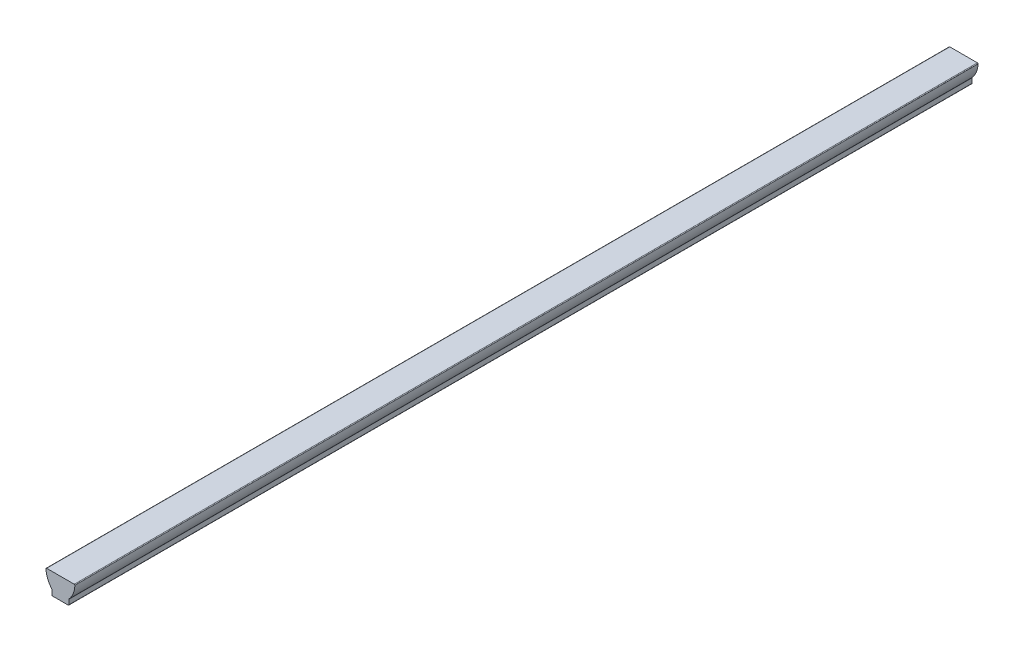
ISO-10303-21;
HEADER;
FILE_DESCRIPTION(('STEP AP214'),'2;1');
FILE_NAME('part.step','',(''),(''),'','','');
FILE_SCHEMA(('AUTOMOTIVE_DESIGN { 1 0 10303 214 1 1 1 1 }'));
ENDSEC;
DATA;
#1=APPLICATION_CONTEXT('core data for automotive mechanical design processes');
#2=APPLICATION_PROTOCOL_DEFINITION('international standard','automotive_design',2000,#1);
#3=PRODUCT_CONTEXT('',#1,'mechanical');
#4=PRODUCT('Part','Part','',(#3));
#5=PRODUCT_RELATED_PRODUCT_CATEGORY('part','',(#4));
#6=PRODUCT_DEFINITION_FORMATION('','',#4);
#7=PRODUCT_DEFINITION_CONTEXT('part definition',#1,'design');
#8=PRODUCT_DEFINITION('design','',#6,#7);
#9=PRODUCT_DEFINITION_SHAPE('','',#8);
#10=(LENGTH_UNIT() NAMED_UNIT(*) SI_UNIT(.MILLI.,.METRE.));
#11=(NAMED_UNIT(*) PLANE_ANGLE_UNIT() SI_UNIT($,.RADIAN.));
#12=(NAMED_UNIT(*) SI_UNIT($,.STERADIAN.) SOLID_ANGLE_UNIT());
#13=UNCERTAINTY_MEASURE_WITH_UNIT(LENGTH_MEASURE(1.E-05),#10,'distance_accuracy_value','');
#14=(GEOMETRIC_REPRESENTATION_CONTEXT(3) GLOBAL_UNCERTAINTY_ASSIGNED_CONTEXT((#13)) GLOBAL_UNIT_ASSIGNED_CONTEXT((#10,
#11,#12)) REPRESENTATION_CONTEXT('',''));
#15=CARTESIAN_POINT('',(0.,0.,0.));
#16=DIRECTION('',(0.,0.,1.));
#17=DIRECTION('',(1.,0.,0.));
#18=AXIS2_PLACEMENT_3D('',#15,#16,#17);
#19=CARTESIAN_POINT('',(-7.74122837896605,11.5062,508.));
#20=DIRECTION('',(0.,0.,-1.));
#21=DIRECTION('',(-1.,0.,0.));
#22=AXIS2_PLACEMENT_3D('',#19,#20,#21);
#23=CYLINDRICAL_SURFACE('',#22,0.381);
#24=CARTESIAN_POINT('',(-7.74122837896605,11.5062,0.));
#25=DIRECTION('',(0.,0.,1.));
#26=DIRECTION('',(-1.,0.,0.));
#27=AXIS2_PLACEMENT_3D('',#24,#25,#26);
#28=CIRCLE('',#27,0.381);
#29=CARTESIAN_POINT('',(-7.74122837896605,11.8872,0.));
#30=VERTEX_POINT('',#29);
#31=CARTESIAN_POINT('',(-8.12205355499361,11.4946594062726,0.));
#32=VERTEX_POINT('',#31);
#33=EDGE_CURVE('E106',#30,#32,#28,.T.);
#34=ORIENTED_EDGE('',*,*,#33,.T.);
#35=DIRECTION('',(0.,0.,-1.));
#36=VECTOR('',#35,1.);
#37=CARTESIAN_POINT('',(-8.12205355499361,11.4946594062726,508.));
#38=LINE('',#37,#36);
#39=CARTESIAN_POINT('',(-8.12205355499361,11.4946594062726,508.));
#40=VERTEX_POINT('',#39);
#41=EDGE_CURVE('E9',#40,#32,#38,.T.);
#42=ORIENTED_EDGE('',*,*,#41,.F.);
#43=CARTESIAN_POINT('',(-7.74122837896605,11.5062,508.));
#44=DIRECTION('',(0.,0.,1.));
#45=DIRECTION('',(-1.,0.,0.));
#46=AXIS2_PLACEMENT_3D('',#43,#44,#45);
#47=CIRCLE('',#46,0.381);
#48=CARTESIAN_POINT('',(-7.74122837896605,11.8872,508.));
#49=VERTEX_POINT('',#48);
#50=EDGE_CURVE('E141',#49,#40,#47,.T.);
#51=ORIENTED_EDGE('',*,*,#50,.F.);
#52=DIRECTION('',(0.,0.,-1.));
#53=VECTOR('',#52,1.);
#54=CARTESIAN_POINT('',(-7.74122837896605,11.8872,508.));
#55=LINE('',#54,#53);
#56=EDGE_CURVE('E119',#49,#30,#55,.T.);
#57=ORIENTED_EDGE('',*,*,#56,.T.);
#58=EDGE_LOOP('',(#34,#42,#51,#57));
#59=FACE_BOUND('',#58,.T.);
#60=ADVANCED_FACE('F14',(#59),#23,.T.);
#61=CARTESIAN_POINT('',(4.83129566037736,11.8872,508.));
#62=DIRECTION('',(0.,0.,-1.));
#63=DIRECTION('',(-1.,0.,0.));
#64=AXIS2_PLACEMENT_3D('',#61,#62,#63);
#65=CYLINDRICAL_SURFACE('',#64,12.9592956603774);
#66=CARTESIAN_POINT('',(4.83129566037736,11.8872,0.));
#67=DIRECTION('',(0.,0.,1.));
#68=DIRECTION('',(1.,0.,0.));
#69=AXIS2_PLACEMENT_3D('',#66,#67,#68);
#70=CIRCLE('',#69,12.9592956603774);
#71=CARTESIAN_POINT('',(-4.85861897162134,3.28203303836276,0.));
#72=VERTEX_POINT('',#71);
#73=EDGE_CURVE('E102',#32,#72,#70,.T.);
#74=ORIENTED_EDGE('',*,*,#73,.T.);
#75=DIRECTION('',(0.,0.,-1.));
#76=VECTOR('',#75,1.);
#77=CARTESIAN_POINT('',(-4.85861897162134,3.28203303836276,508.));
#78=LINE('',#77,#76);
#79=CARTESIAN_POINT('',(-4.85861897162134,3.28203303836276,508.));
#80=VERTEX_POINT('',#79);
#81=EDGE_CURVE('E21',#80,#72,#78,.T.);
#82=ORIENTED_EDGE('',*,*,#81,.F.);
#83=CARTESIAN_POINT('',(4.83129566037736,11.8872,508.));
#84=DIRECTION('',(0.,0.,1.));
#85=DIRECTION('',(1.,0.,0.));
#86=AXIS2_PLACEMENT_3D('',#83,#84,#85);
#87=CIRCLE('',#86,12.9592956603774);
#88=EDGE_CURVE('E115',#40,#80,#87,.T.);
#89=ORIENTED_EDGE('',*,*,#88,.F.);
#90=ORIENTED_EDGE('',*,*,#41,.T.);
#91=EDGE_LOOP('',(#74,#82,#89,#90));
#92=FACE_BOUND('',#91,.T.);
#93=ADVANCED_FACE('F114',(#92),#65,.T.);
#94=CARTESIAN_POINT('',(-5.1435,3.0290433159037,508.));
#95=DIRECTION('',(0.,0.,-1.));
#96=DIRECTION('',(-1.,0.,0.));
#97=AXIS2_PLACEMENT_3D('',#94,#95,#96);
#98=CYLINDRICAL_SURFACE('',#97,0.381);
#99=CARTESIAN_POINT('',(-5.1435,3.0290433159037,0.));
#100=DIRECTION('',(0.,0.,-1.));
#101=DIRECTION('',(-1.,0.,0.));
#102=AXIS2_PLACEMENT_3D('',#99,#100,#101);
#103=CIRCLE('',#102,0.381);
#104=CARTESIAN_POINT('',(-4.7625,3.0290433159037,0.));
#105=VERTEX_POINT('',#104);
#106=EDGE_CURVE('E108',#72,#105,#103,.T.);
#107=ORIENTED_EDGE('',*,*,#106,.T.);
#108=DIRECTION('',(0.,0.,-1.));
#109=VECTOR('',#108,1.);
#110=CARTESIAN_POINT('',(-4.7625,3.0290433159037,508.));
#111=LINE('',#110,#109);
#112=CARTESIAN_POINT('',(-4.7625,3.0290433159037,508.));
#113=VERTEX_POINT('',#112);
#114=EDGE_CURVE('E187',#113,#105,#111,.T.);
#115=ORIENTED_EDGE('',*,*,#114,.F.);
#116=CARTESIAN_POINT('',(-5.1435,3.0290433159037,508.));
#117=DIRECTION('',(0.,0.,-1.));
#118=DIRECTION('',(-1.,0.,0.));
#119=AXIS2_PLACEMENT_3D('',#116,#117,#118);
#120=CIRCLE('',#119,0.381);
#121=EDGE_CURVE('E144',#80,#113,#120,.T.);
#122=ORIENTED_EDGE('',*,*,#121,.F.);
#123=ORIENTED_EDGE('',*,*,#81,.T.);
#124=EDGE_LOOP('',(#107,#115,#122,#123));
#125=FACE_BOUND('',#124,.T.);
#126=ADVANCED_FACE('F191',(#125),#98,.F.);
#127=CARTESIAN_POINT('',(-4.7625,0.381,508.));
#128=DIRECTION('',(1.,0.,0.));
#129=DIRECTION('',(0.,0.,-1.));
#130=AXIS2_PLACEMENT_3D('',#127,#128,#129);
#131=PLANE('',#130);
#132=DIRECTION('',(0.,-1.,0.));
#133=VECTOR('',#132,1.);
#134=CARTESIAN_POINT('',(-4.7625,0.381,0.));
#135=LINE('',#134,#133);
#136=CARTESIAN_POINT('',(-4.7625,0.381,0.));
#137=VERTEX_POINT('',#136);
#138=EDGE_CURVE('E123',#105,#137,#135,.T.);
#139=ORIENTED_EDGE('',*,*,#138,.T.);
#140=DIRECTION('',(0.,0.,-1.));
#141=VECTOR('',#140,1.);
#142=CARTESIAN_POINT('',(-4.7625,0.381,508.));
#143=LINE('',#142,#141);
#144=CARTESIAN_POINT('',(-4.7625,0.381,508.));
#145=VERTEX_POINT('',#144);
#146=EDGE_CURVE('E184',#145,#137,#143,.T.);
#147=ORIENTED_EDGE('',*,*,#146,.F.);
#148=DIRECTION('',(0.,-1.,0.));
#149=VECTOR('',#148,1.);
#150=CARTESIAN_POINT('',(-4.7625,0.381,508.));
#151=LINE('',#150,#149);
#152=EDGE_CURVE('E146',#113,#145,#151,.T.);
#153=ORIENTED_EDGE('',*,*,#152,.F.);
#154=ORIENTED_EDGE('',*,*,#114,.T.);
#155=EDGE_LOOP('',(#139,#147,#153,#154));
#156=FACE_BOUND('',#155,.T.);
#157=ADVANCED_FACE('F199',(#156),#131,.F.);
#158=CARTESIAN_POINT('',(-4.3815,0.381,508.));
#159=DIRECTION('',(0.,0.,-1.));
#160=DIRECTION('',(-1.,0.,0.));
#161=AXIS2_PLACEMENT_3D('',#158,#159,#160);
#162=CYLINDRICAL_SURFACE('',#161,0.381);
#163=CARTESIAN_POINT('',(-4.3815,0.381,0.));
#164=DIRECTION('',(0.,0.,1.));
#165=DIRECTION('',(1.,0.,0.));
#166=AXIS2_PLACEMENT_3D('',#163,#164,#165);
#167=CIRCLE('',#166,0.381);
#168=CARTESIAN_POINT('',(-4.3815,0.,0.));
#169=VERTEX_POINT('',#168);
#170=EDGE_CURVE('E125',#137,#169,#167,.T.);
#171=ORIENTED_EDGE('',*,*,#170,.T.);
#172=DIRECTION('',(0.,0.,-1.));
#173=VECTOR('',#172,1.);
#174=CARTESIAN_POINT('',(-4.3815,0.,508.));
#175=LINE('',#174,#173);
#176=CARTESIAN_POINT('',(-4.3815,0.,508.));
#177=VERTEX_POINT('',#176);
#178=EDGE_CURVE('E181',#177,#169,#175,.T.);
#179=ORIENTED_EDGE('',*,*,#178,.F.);
#180=CARTESIAN_POINT('',(-4.3815,0.381,508.));
#181=DIRECTION('',(0.,0.,1.));
#182=DIRECTION('',(1.,0.,0.));
#183=AXIS2_PLACEMENT_3D('',#180,#181,#182);
#184=CIRCLE('',#183,0.381);
#185=EDGE_CURVE('E148',#145,#177,#184,.T.);
#186=ORIENTED_EDGE('',*,*,#185,.F.);
#187=ORIENTED_EDGE('',*,*,#146,.T.);
#188=EDGE_LOOP('',(#171,#179,#186,#187));
#189=FACE_BOUND('',#188,.T.);
#190=ADVANCED_FACE('F202',(#189),#162,.T.);
#191=CARTESIAN_POINT('',(-4.3815,0.,508.));
#192=DIRECTION('',(0.,1.,0.));
#193=DIRECTION('',(0.,0.,1.));
#194=AXIS2_PLACEMENT_3D('',#191,#192,#193);
#195=PLANE('',#194);
#196=DIRECTION('',(1.,0.,0.));
#197=VECTOR('',#196,1.);
#198=CARTESIAN_POINT('',(-4.3815,0.,0.));
#199=LINE('',#198,#197);
#200=CARTESIAN_POINT('',(4.3815,0.,0.));
#201=VERTEX_POINT('',#200);
#202=EDGE_CURVE('E127',#169,#201,#199,.T.);
#203=ORIENTED_EDGE('',*,*,#202,.T.);
#204=DIRECTION('',(0.,0.,-1.));
#205=VECTOR('',#204,1.);
#206=CARTESIAN_POINT('',(4.3815,0.,508.));
#207=LINE('',#206,#205);
#208=CARTESIAN_POINT('',(4.3815,0.,508.));
#209=VERTEX_POINT('',#208);
#210=EDGE_CURVE('E178',#209,#201,#207,.T.);
#211=ORIENTED_EDGE('',*,*,#210,.F.);
#212=DIRECTION('',(1.,0.,0.));
#213=VECTOR('',#212,1.);
#214=CARTESIAN_POINT('',(-4.3815,0.,508.));
#215=LINE('',#214,#213);
#216=EDGE_CURVE('E150',#177,#209,#215,.T.);
#217=ORIENTED_EDGE('',*,*,#216,.F.);
#218=ORIENTED_EDGE('',*,*,#178,.T.);
#219=EDGE_LOOP('',(#203,#211,#217,#218));
#220=FACE_BOUND('',#219,.T.);
#221=ADVANCED_FACE('F207',(#220),#195,.F.);
#222=CARTESIAN_POINT('',(4.3815,0.381,508.));
#223=DIRECTION('',(0.,0.,-1.));
#224=DIRECTION('',(-1.,0.,0.));
#225=AXIS2_PLACEMENT_3D('',#222,#223,#224);
#226=CYLINDRICAL_SURFACE('',#225,0.381);
#227=CARTESIAN_POINT('',(4.3815,0.381,0.));
#228=DIRECTION('',(0.,0.,1.));
#229=DIRECTION('',(1.,0.,0.));
#230=AXIS2_PLACEMENT_3D('',#227,#228,#229);
#231=CIRCLE('',#230,0.381);
#232=CARTESIAN_POINT('',(4.7625,0.381,0.));
#233=VERTEX_POINT('',#232);
#234=EDGE_CURVE('E129',#201,#233,#231,.T.);
#235=ORIENTED_EDGE('',*,*,#234,.T.);
#236=DIRECTION('',(0.,0.,-1.));
#237=VECTOR('',#236,1.);
#238=CARTESIAN_POINT('',(4.7625,0.381,508.));
#239=LINE('',#238,#237);
#240=CARTESIAN_POINT('',(4.7625,0.381,508.));
#241=VERTEX_POINT('',#240);
#242=EDGE_CURVE('E175',#241,#233,#239,.T.);
#243=ORIENTED_EDGE('',*,*,#242,.F.);
#244=CARTESIAN_POINT('',(4.3815,0.381,508.));
#245=DIRECTION('',(0.,0.,1.));
#246=DIRECTION('',(1.,0.,0.));
#247=AXIS2_PLACEMENT_3D('',#244,#245,#246);
#248=CIRCLE('',#247,0.381);
#249=EDGE_CURVE('E152',#209,#241,#248,.T.);
#250=ORIENTED_EDGE('',*,*,#249,.F.);
#251=ORIENTED_EDGE('',*,*,#210,.T.);
#252=EDGE_LOOP('',(#235,#243,#250,#251));
#253=FACE_BOUND('',#252,.T.);
#254=ADVANCED_FACE('F213',(#253),#226,.T.);
#255=CARTESIAN_POINT('',(4.7625,0.381,508.));
#256=DIRECTION('',(-1.,0.,0.));
#257=DIRECTION('',(0.,0.,1.));
#258=AXIS2_PLACEMENT_3D('',#255,#256,#257);
#259=PLANE('',#258);
#260=DIRECTION('',(0.,1.,0.));
#261=VECTOR('',#260,1.);
#262=CARTESIAN_POINT('',(4.7625,0.381,0.));
#263=LINE('',#262,#261);
#264=CARTESIAN_POINT('',(4.7625,3.0290433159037,0.));
#265=VERTEX_POINT('',#264);
#266=EDGE_CURVE('E131',#233,#265,#263,.T.);
#267=ORIENTED_EDGE('',*,*,#266,.T.);
#268=DIRECTION('',(0.,0.,-1.));
#269=VECTOR('',#268,1.);
#270=CARTESIAN_POINT('',(4.7625,3.0290433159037,508.));
#271=LINE('',#270,#269);
#272=CARTESIAN_POINT('',(4.7625,3.0290433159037,508.));
#273=VERTEX_POINT('',#272);
#274=EDGE_CURVE('E172',#273,#265,#271,.T.);
#275=ORIENTED_EDGE('',*,*,#274,.F.);
#276=DIRECTION('',(0.,1.,0.));
#277=VECTOR('',#276,1.);
#278=CARTESIAN_POINT('',(4.7625,0.381,508.));
#279=LINE('',#278,#277);
#280=EDGE_CURVE('E154',#241,#273,#279,.T.);
#281=ORIENTED_EDGE('',*,*,#280,.F.);
#282=ORIENTED_EDGE('',*,*,#242,.T.);
#283=EDGE_LOOP('',(#267,#275,#281,#282));
#284=FACE_BOUND('',#283,.T.);
#285=ADVANCED_FACE('F217',(#284),#259,.F.);
#286=CARTESIAN_POINT('',(5.1435,3.0290433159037,508.));
#287=DIRECTION('',(0.,0.,-1.));
#288=DIRECTION('',(-1.,0.,0.));
#289=AXIS2_PLACEMENT_3D('',#286,#287,#288);
#290=CYLINDRICAL_SURFACE('',#289,0.381);
#291=CARTESIAN_POINT('',(5.1435,3.0290433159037,0.));
#292=DIRECTION('',(0.,0.,-1.));
#293=DIRECTION('',(-1.,0.,0.));
#294=AXIS2_PLACEMENT_3D('',#291,#292,#293);
#295=CIRCLE('',#294,0.381);
#296=CARTESIAN_POINT('',(4.85861897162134,3.28203303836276,0.));
#297=VERTEX_POINT('',#296);
#298=EDGE_CURVE('E133',#265,#297,#295,.T.);
#299=ORIENTED_EDGE('',*,*,#298,.T.);
#300=DIRECTION('',(0.,0.,-1.));
#301=VECTOR('',#300,1.);
#302=CARTESIAN_POINT('',(4.85861897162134,3.28203303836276,508.));
#303=LINE('',#302,#301);
#304=CARTESIAN_POINT('',(4.85861897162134,3.28203303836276,508.));
#305=VERTEX_POINT('',#304);
#306=EDGE_CURVE('E169',#305,#297,#303,.T.);
#307=ORIENTED_EDGE('',*,*,#306,.F.);
#308=CARTESIAN_POINT('',(5.1435,3.0290433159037,508.));
#309=DIRECTION('',(0.,0.,-1.));
#310=DIRECTION('',(-1.,0.,0.));
#311=AXIS2_PLACEMENT_3D('',#308,#309,#310);
#312=CIRCLE('',#311,0.381);
#313=EDGE_CURVE('E156',#273,#305,#312,.T.);
#314=ORIENTED_EDGE('',*,*,#313,.F.);
#315=ORIENTED_EDGE('',*,*,#274,.T.);
#316=EDGE_LOOP('',(#299,#307,#314,#315));
#317=FACE_BOUND('',#316,.T.);
#318=ADVANCED_FACE('F222',(#317),#290,.F.);
#319=CARTESIAN_POINT('',(-4.83129566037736,11.8872,508.));
#320=DIRECTION('',(0.,0.,-1.));
#321=DIRECTION('',(-1.,0.,0.));
#322=AXIS2_PLACEMENT_3D('',#319,#320,#321);
#323=CYLINDRICAL_SURFACE('',#322,12.9592956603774);
#324=CARTESIAN_POINT('',(-4.83129566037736,11.8872,0.));
#325=DIRECTION('',(0.,0.,1.));
#326=DIRECTION('',(-1.,0.,0.));
#327=AXIS2_PLACEMENT_3D('',#324,#325,#326);
#328=CIRCLE('',#327,12.9592956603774);
#329=CARTESIAN_POINT('',(8.12205355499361,11.4946594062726,0.));
#330=VERTEX_POINT('',#329);
#331=EDGE_CURVE('E135',#297,#330,#328,.T.);
#332=ORIENTED_EDGE('',*,*,#331,.T.);
#333=DIRECTION('',(0.,0.,-1.));
#334=VECTOR('',#333,1.);
#335=CARTESIAN_POINT('',(8.12205355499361,11.4946594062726,508.));
#336=LINE('',#335,#334);
#337=CARTESIAN_POINT('',(8.12205355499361,11.4946594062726,508.));
#338=VERTEX_POINT('',#337);
#339=EDGE_CURVE('E166',#338,#330,#336,.T.);
#340=ORIENTED_EDGE('',*,*,#339,.F.);
#341=CARTESIAN_POINT('',(-4.83129566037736,11.8872,508.));
#342=DIRECTION('',(0.,0.,1.));
#343=DIRECTION('',(-1.,0.,0.));
#344=AXIS2_PLACEMENT_3D('',#341,#342,#343);
#345=CIRCLE('',#344,12.9592956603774);
#346=EDGE_CURVE('E158',#305,#338,#345,.T.);
#347=ORIENTED_EDGE('',*,*,#346,.F.);
#348=ORIENTED_EDGE('',*,*,#306,.T.);
#349=EDGE_LOOP('',(#332,#340,#347,#348));
#350=FACE_BOUND('',#349,.T.);
#351=ADVANCED_FACE('F226',(#350),#323,.T.);
#352=CARTESIAN_POINT('',(7.74122837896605,11.5062,508.));
#353=DIRECTION('',(0.,0.,-1.));
#354=DIRECTION('',(-1.,0.,0.));
#355=AXIS2_PLACEMENT_3D('',#352,#353,#354);
#356=CYLINDRICAL_SURFACE('',#355,0.381);
#357=CARTESIAN_POINT('',(7.74122837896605,11.5062,0.));
#358=DIRECTION('',(0.,0.,1.));
#359=DIRECTION('',(-1.,0.,0.));
#360=AXIS2_PLACEMENT_3D('',#357,#358,#359);
#361=CIRCLE('',#360,0.381);
#362=CARTESIAN_POINT('',(7.74122837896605,11.8872,0.));
#363=VERTEX_POINT('',#362);
#364=EDGE_CURVE('E137',#330,#363,#361,.T.);
#365=ORIENTED_EDGE('',*,*,#364,.T.);
#366=DIRECTION('',(0.,0.,-1.));
#367=VECTOR('',#366,1.);
#368=CARTESIAN_POINT('',(7.74122837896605,11.8872,508.));
#369=LINE('',#368,#367);
#370=CARTESIAN_POINT('',(7.74122837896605,11.8872,508.));
#371=VERTEX_POINT('',#370);
#372=EDGE_CURVE('E163',#371,#363,#369,.T.);
#373=ORIENTED_EDGE('',*,*,#372,.F.);
#374=CARTESIAN_POINT('',(7.74122837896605,11.5062,508.));
#375=DIRECTION('',(0.,0.,1.));
#376=DIRECTION('',(-1.,0.,0.));
#377=AXIS2_PLACEMENT_3D('',#374,#375,#376);
#378=CIRCLE('',#377,0.381);
#379=EDGE_CURVE('E33',#338,#371,#378,.T.);
#380=ORIENTED_EDGE('',*,*,#379,.F.);
#381=ORIENTED_EDGE('',*,*,#339,.T.);
#382=EDGE_LOOP('',(#365,#373,#380,#381));
#383=FACE_BOUND('',#382,.T.);
#384=ADVANCED_FACE('F230',(#383),#356,.T.);
#385=CARTESIAN_POINT('',(-7.74122837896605,11.8872,508.));
#386=DIRECTION('',(0.,-1.,0.));
#387=DIRECTION('',(0.,0.,-1.));
#388=AXIS2_PLACEMENT_3D('',#385,#386,#387);
#389=PLANE('',#388);
#390=DIRECTION('',(-1.,0.,0.));
#391=VECTOR('',#390,1.);
#392=CARTESIAN_POINT('',(-7.74122837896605,11.8872,0.));
#393=LINE('',#392,#391);
#394=EDGE_CURVE('E139',#363,#30,#393,.T.);
#395=ORIENTED_EDGE('',*,*,#394,.T.);
#396=ORIENTED_EDGE('',*,*,#56,.F.);
#397=DIRECTION('',(-1.,0.,0.));
#398=VECTOR('',#397,1.);
#399=CARTESIAN_POINT('',(-7.74122837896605,11.8872,508.));
#400=LINE('',#399,#398);
#401=EDGE_CURVE('E28',#371,#49,#400,.T.);
#402=ORIENTED_EDGE('',*,*,#401,.F.);
#403=ORIENTED_EDGE('',*,*,#372,.T.);
#404=EDGE_LOOP('',(#395,#396,#402,#403));
#405=FACE_BOUND('',#404,.T.);
#406=ADVANCED_FACE('F232',(#405),#389,.F.);
#407=CARTESIAN_POINT('',(-7.74122837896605,11.5062,508.));
#408=DIRECTION('',(0.,0.,-1.));
#409=DIRECTION('',(-1.,0.,0.));
#410=AXIS2_PLACEMENT_3D('',#407,#408,#409);
#411=PLANE('',#410);
#412=ORIENTED_EDGE('',*,*,#50,.T.);
#413=ORIENTED_EDGE('',*,*,#88,.T.);
#414=ORIENTED_EDGE('',*,*,#121,.T.);
#415=ORIENTED_EDGE('',*,*,#152,.T.);
#416=ORIENTED_EDGE('',*,*,#185,.T.);
#417=ORIENTED_EDGE('',*,*,#216,.T.);
#418=ORIENTED_EDGE('',*,*,#249,.T.);
#419=ORIENTED_EDGE('',*,*,#280,.T.);
#420=ORIENTED_EDGE('',*,*,#313,.T.);
#421=ORIENTED_EDGE('',*,*,#346,.T.);
#422=ORIENTED_EDGE('',*,*,#379,.T.);
#423=ORIENTED_EDGE('',*,*,#401,.T.);
#424=EDGE_LOOP('',(#412,#413,#414,#415,#416,#417,#418,#419,#420,#421,#422,#423));
#425=FACE_BOUND('',#424,.T.);
#426=ADVANCED_FACE('F194',(#425),#411,.F.);
#427=CARTESIAN_POINT('',(-7.74122837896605,11.5062,0.));
#428=DIRECTION('',(0.,0.,-1.));
#429=DIRECTION('',(-1.,0.,0.));
#430=AXIS2_PLACEMENT_3D('',#427,#428,#429);
#431=PLANE('',#430);
#432=ORIENTED_EDGE('',*,*,#33,.F.);
#433=ORIENTED_EDGE('',*,*,#394,.F.);
#434=ORIENTED_EDGE('',*,*,#364,.F.);
#435=ORIENTED_EDGE('',*,*,#331,.F.);
#436=ORIENTED_EDGE('',*,*,#298,.F.);
#437=ORIENTED_EDGE('',*,*,#266,.F.);
#438=ORIENTED_EDGE('',*,*,#234,.F.);
#439=ORIENTED_EDGE('',*,*,#202,.F.);
#440=ORIENTED_EDGE('',*,*,#170,.F.);
#441=ORIENTED_EDGE('',*,*,#138,.F.);
#442=ORIENTED_EDGE('',*,*,#106,.F.);
#443=ORIENTED_EDGE('',*,*,#73,.F.);
#444=EDGE_LOOP('',(#432,#433,#434,#435,#436,#437,#438,#439,#440,#441,#442,#443));
#445=FACE_BOUND('',#444,.T.);
#446=ADVANCED_FACE('F103',(#445),#431,.T.);
#447=CLOSED_SHELL('',(#60,#93,#126,#157,#190,#221,#254,#285,#318,#351,#384,#406,#426,#446));
#448=MANIFOLD_SOLID_BREP('B1',#447);
#449=ADVANCED_BREP_SHAPE_REPRESENTATION('',(#18,#448),#14);
#450=SHAPE_DEFINITION_REPRESENTATION(#9,#449);
ENDSEC;
END-ISO-10303-21;
